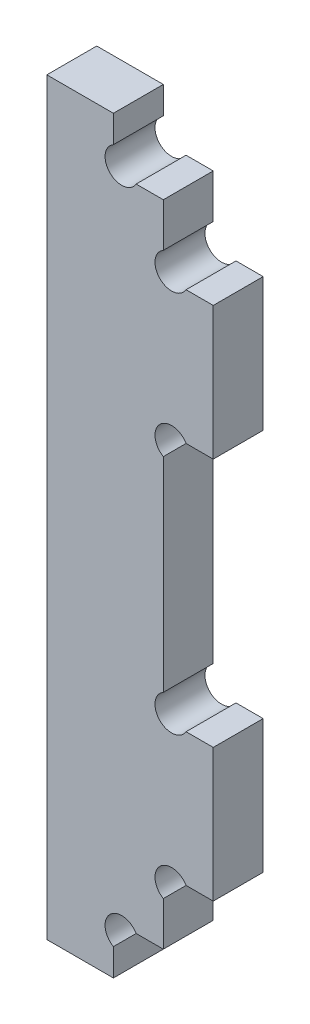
ISO-10303-21;
HEADER;
FILE_DESCRIPTION(('STEP AP214'),'2;1');
FILE_NAME('part.step','',(''),(''),'','','');
FILE_SCHEMA(('AUTOMOTIVE_DESIGN { 1 0 10303 214 1 1 1 1 }'));
ENDSEC;
DATA;
#1=APPLICATION_CONTEXT('core data for automotive mechanical design processes');
#2=APPLICATION_PROTOCOL_DEFINITION('international standard','automotive_design',2000,#1);
#3=PRODUCT_CONTEXT('',#1,'mechanical');
#4=PRODUCT('Part','Part','',(#3));
#5=PRODUCT_RELATED_PRODUCT_CATEGORY('part','',(#4));
#6=PRODUCT_DEFINITION_FORMATION('','',#4);
#7=PRODUCT_DEFINITION_CONTEXT('part definition',#1,'design');
#8=PRODUCT_DEFINITION('design','',#6,#7);
#9=PRODUCT_DEFINITION_SHAPE('','',#8);
#10=(LENGTH_UNIT() NAMED_UNIT(*) SI_UNIT(.MILLI.,.METRE.));
#11=(NAMED_UNIT(*) PLANE_ANGLE_UNIT() SI_UNIT($,.RADIAN.));
#12=(NAMED_UNIT(*) SI_UNIT($,.STERADIAN.) SOLID_ANGLE_UNIT());
#13=UNCERTAINTY_MEASURE_WITH_UNIT(LENGTH_MEASURE(1.E-05),#10,'distance_accuracy_value','');
#14=(GEOMETRIC_REPRESENTATION_CONTEXT(3) GLOBAL_UNCERTAINTY_ASSIGNED_CONTEXT((#13)) GLOBAL_UNIT_ASSIGNED_CONTEXT((#10,
#11,#12)) REPRESENTATION_CONTEXT('',''));
#15=CARTESIAN_POINT('',(0.,0.,0.));
#16=DIRECTION('',(0.,0.,1.));
#17=DIRECTION('',(1.,0.,0.));
#18=AXIS2_PLACEMENT_3D('',#15,#16,#17);
#19=CARTESIAN_POINT('',(0.,0.,3.));
#20=DIRECTION('',(0.,0.,-1.));
#21=DIRECTION('',(-1.,0.,0.));
#22=AXIS2_PLACEMENT_3D('',#19,#20,#21);
#23=PLANE('',#22);
#24=CARTESIAN_POINT('',(1.,20.,3.));
#25=DIRECTION('',(0.,0.,1.));
#26=DIRECTION('',(1.,0.,0.));
#27=AXIS2_PLACEMENT_3D('',#24,#25,#26);
#28=CIRCLE('',#27,0.999999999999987);
#29=CARTESIAN_POINT('',(0.500000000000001,20.8660254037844,3.));
#30=VERTEX_POINT('',#29);
#31=CARTESIAN_POINT('',(1.86602540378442,19.5,3.));
#32=VERTEX_POINT('',#31);
#33=EDGE_CURVE('E192',#30,#32,#28,.T.);
#34=ORIENTED_EDGE('',*,*,#33,.F.);
#35=DIRECTION('',(0.,1.,0.));
#36=VECTOR('',#35,1.);
#37=CARTESIAN_POINT('',(0.5,19.5,3.));
#38=LINE('',#37,#36);
#39=CARTESIAN_POINT('',(0.5,22.5,3.));
#40=VERTEX_POINT('',#39);
#41=EDGE_CURVE('E200',#30,#40,#38,.T.);
#42=ORIENTED_EDGE('',*,*,#41,.T.);
#43=DIRECTION('',(-1.,0.,0.));
#44=VECTOR('',#43,1.);
#45=CARTESIAN_POINT('',(-3.5,22.5,3.));
#46=LINE('',#45,#44);
#47=CARTESIAN_POINT('',(-3.5,22.5,3.));
#48=VERTEX_POINT('',#47);
#49=EDGE_CURVE('E213',#40,#48,#46,.T.);
#50=ORIENTED_EDGE('',*,*,#49,.T.);
#51=DIRECTION('',(0.,-1.,0.));
#52=VECTOR('',#51,1.);
#53=CARTESIAN_POINT('',(-3.5,-19.5,3.));
#54=LINE('',#53,#52);
#55=CARTESIAN_POINT('',(-3.5,-22.5,3.));
#56=VERTEX_POINT('',#55);
#57=EDGE_CURVE('E230',#48,#56,#54,.T.);
#58=ORIENTED_EDGE('',*,*,#57,.T.);
#59=DIRECTION('',(1.,0.,0.));
#60=VECTOR('',#59,1.);
#61=CARTESIAN_POINT('',(-3.5,-22.5,3.));
#62=LINE('',#61,#60);
#63=CARTESIAN_POINT('',(0.5,-22.5,3.));
#64=VERTEX_POINT('',#63);
#65=EDGE_CURVE('E269',#56,#64,#62,.T.);
#66=ORIENTED_EDGE('',*,*,#65,.T.);
#67=DIRECTION('',(0.,1.,0.));
#68=VECTOR('',#67,1.);
#69=CARTESIAN_POINT('',(0.5,-19.5,3.));
#70=LINE('',#69,#68);
#71=CARTESIAN_POINT('',(0.500000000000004,-20.8660254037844,3.));
#72=VERTEX_POINT('',#71);
#73=EDGE_CURVE('E259',#64,#72,#70,.T.);
#74=ORIENTED_EDGE('',*,*,#73,.T.);
#75=CARTESIAN_POINT('',(1.,-20.,3.));
#76=DIRECTION('',(0.,0.,1.));
#77=DIRECTION('',(1.,0.,0.));
#78=AXIS2_PLACEMENT_3D('',#75,#76,#77);
#79=CIRCLE('',#78,0.999999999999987);
#80=CARTESIAN_POINT('',(1.86602540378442,-19.5,3.));
#81=VERTEX_POINT('',#80);
#82=EDGE_CURVE('E266',#81,#72,#79,.T.);
#83=ORIENTED_EDGE('',*,*,#82,.F.);
#84=DIRECTION('',(1.,0.,0.));
#85=VECTOR('',#84,1.);
#86=CARTESIAN_POINT('',(-3.5,-19.5,3.));
#87=LINE('',#86,#85);
#88=CARTESIAN_POINT('',(3.5,-19.5,3.));
#89=VERTEX_POINT('',#88);
#90=EDGE_CURVE('E232',#81,#89,#87,.T.);
#91=ORIENTED_EDGE('',*,*,#90,.T.);
#92=DIRECTION('',(0.,1.,0.));
#93=VECTOR('',#92,1.);
#94=CARTESIAN_POINT('',(3.5,-19.5,3.));
#95=LINE('',#94,#93);
#96=CARTESIAN_POINT('',(3.5,-16.8660254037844,3.));
#97=VERTEX_POINT('',#96);
#98=EDGE_CURVE('E222',#89,#97,#95,.T.);
#99=ORIENTED_EDGE('',*,*,#98,.T.);
#100=CARTESIAN_POINT('',(4.,-16.,3.));
#101=DIRECTION('',(0.,0.,1.));
#102=DIRECTION('',(1.,0.,0.));
#103=AXIS2_PLACEMENT_3D('',#100,#101,#102);
#104=CIRCLE('',#103,0.999999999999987);
#105=CARTESIAN_POINT('',(4.86602540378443,-15.5,3.));
#106=VERTEX_POINT('',#105);
#107=EDGE_CURVE('E309',#106,#97,#104,.T.);
#108=ORIENTED_EDGE('',*,*,#107,.F.);
#109=DIRECTION('',(1.,0.,0.));
#110=VECTOR('',#109,1.);
#111=CARTESIAN_POINT('',(3.5,-15.5,3.));
#112=LINE('',#111,#110);
#113=CARTESIAN_POINT('',(6.5,-15.5,3.));
#114=VERTEX_POINT('',#113);
#115=EDGE_CURVE('E341',#106,#114,#112,.T.);
#116=ORIENTED_EDGE('',*,*,#115,.T.);
#117=DIRECTION('',(0.,1.,0.));
#118=VECTOR('',#117,1.);
#119=CARTESIAN_POINT('',(6.5,-15.5,3.));
#120=LINE('',#119,#118);
#121=CARTESIAN_POINT('',(6.5,-7.5,3.));
#122=VERTEX_POINT('',#121);
#123=EDGE_CURVE('E343',#114,#122,#120,.T.);
#124=ORIENTED_EDGE('',*,*,#123,.T.);
#125=DIRECTION('',(-1.,0.,0.));
#126=VECTOR('',#125,1.);
#127=CARTESIAN_POINT('',(3.5,-7.5,3.));
#128=LINE('',#127,#126);
#129=CARTESIAN_POINT('',(4.86602540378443,-7.5,3.));
#130=VERTEX_POINT('',#129);
#131=EDGE_CURVE('E346',#122,#130,#128,.T.);
#132=ORIENTED_EDGE('',*,*,#131,.T.);
#133=CARTESIAN_POINT('',(4.,-7.,3.));
#134=DIRECTION('',(0.,0.,1.));
#135=DIRECTION('',(1.,0.,0.));
#136=AXIS2_PLACEMENT_3D('',#133,#134,#135);
#137=CIRCLE('',#136,0.999999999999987);
#138=CARTESIAN_POINT('',(3.5,-6.13397459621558,3.));
#139=VERTEX_POINT('',#138);
#140=EDGE_CURVE('E296',#139,#130,#137,.T.);
#141=ORIENTED_EDGE('',*,*,#140,.F.);
#142=CARTESIAN_POINT('',(3.5,6.13397459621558,3.));
#143=VERTEX_POINT('',#142);
#144=EDGE_CURVE('E226',#139,#143,#95,.T.);
#145=ORIENTED_EDGE('',*,*,#144,.T.);
#146=CARTESIAN_POINT('',(4.,7.,3.));
#147=DIRECTION('',(0.,0.,1.));
#148=DIRECTION('',(1.,0.,0.));
#149=AXIS2_PLACEMENT_3D('',#146,#147,#148);
#150=CIRCLE('',#149,0.999999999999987);
#151=CARTESIAN_POINT('',(4.86602540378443,7.5,3.));
#152=VERTEX_POINT('',#151);
#153=EDGE_CURVE('E431',#152,#143,#150,.T.);
#154=ORIENTED_EDGE('',*,*,#153,.F.);
#155=DIRECTION('',(1.,0.,0.));
#156=VECTOR('',#155,1.);
#157=CARTESIAN_POINT('',(3.5,7.5,3.));
#158=LINE('',#157,#156);
#159=CARTESIAN_POINT('',(6.5,7.5,3.));
#160=VERTEX_POINT('',#159);
#161=EDGE_CURVE('E321',#152,#160,#158,.T.);
#162=ORIENTED_EDGE('',*,*,#161,.T.);
#163=DIRECTION('',(0.,1.,0.));
#164=VECTOR('',#163,1.);
#165=CARTESIAN_POINT('',(6.5,15.5,3.));
#166=LINE('',#165,#164);
#167=CARTESIAN_POINT('',(6.5,15.5,3.));
#168=VERTEX_POINT('',#167);
#169=EDGE_CURVE('E323',#160,#168,#166,.T.);
#170=ORIENTED_EDGE('',*,*,#169,.T.);
#171=DIRECTION('',(-1.,0.,0.));
#172=VECTOR('',#171,1.);
#173=CARTESIAN_POINT('',(3.5,15.5,3.));
#174=LINE('',#173,#172);
#175=CARTESIAN_POINT('',(4.86602540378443,15.5,3.));
#176=VERTEX_POINT('',#175);
#177=EDGE_CURVE('E326',#168,#176,#174,.T.);
#178=ORIENTED_EDGE('',*,*,#177,.T.);
#179=CARTESIAN_POINT('',(4.,16.,3.));
#180=DIRECTION('',(0.,0.,1.));
#181=DIRECTION('',(1.,0.,0.));
#182=AXIS2_PLACEMENT_3D('',#179,#180,#181);
#183=CIRCLE('',#182,0.999999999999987);
#184=CARTESIAN_POINT('',(3.5,16.8660254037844,3.));
#185=VERTEX_POINT('',#184);
#186=EDGE_CURVE('E439',#185,#176,#183,.T.);
#187=ORIENTED_EDGE('',*,*,#186,.F.);
#188=CARTESIAN_POINT('',(3.5,19.5,3.));
#189=VERTEX_POINT('',#188);
#190=EDGE_CURVE('E227',#185,#189,#95,.T.);
#191=ORIENTED_EDGE('',*,*,#190,.T.);
#192=DIRECTION('',(-1.,0.,0.));
#193=VECTOR('',#192,1.);
#194=CARTESIAN_POINT('',(-3.5,19.5,3.));
#195=LINE('',#194,#193);
#196=EDGE_CURVE('E225',#189,#32,#195,.T.);
#197=ORIENTED_EDGE('',*,*,#196,.T.);
#198=EDGE_LOOP('',(#34,#42,#50,#58,#66,#74,#83,#91,#99,#108,#116,#124,#132,#141,#145,#154,#162,
#170,#178,#187,#191,#197));
#199=FACE_BOUND('',#198,.T.);
#200=ADVANCED_FACE('F37',(#199),#23,.F.);
#201=CARTESIAN_POINT('',(0.,0.,0.));
#202=DIRECTION('',(0.,0.,-1.));
#203=DIRECTION('',(-1.,0.,0.));
#204=AXIS2_PLACEMENT_3D('',#201,#202,#203);
#205=PLANE('',#204);
#206=DIRECTION('',(0.,1.,0.));
#207=VECTOR('',#206,1.);
#208=CARTESIAN_POINT('',(0.5,19.5,0.));
#209=LINE('',#208,#207);
#210=CARTESIAN_POINT('',(0.500000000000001,20.8660254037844,0.));
#211=VERTEX_POINT('',#210);
#212=CARTESIAN_POINT('',(0.5,22.5,0.));
#213=VERTEX_POINT('',#212);
#214=EDGE_CURVE('E198',#211,#213,#209,.T.);
#215=ORIENTED_EDGE('',*,*,#214,.F.);
#216=CARTESIAN_POINT('',(1.,20.,0.));
#217=DIRECTION('',(0.,0.,1.));
#218=DIRECTION('',(1.,0.,0.));
#219=AXIS2_PLACEMENT_3D('',#216,#217,#218);
#220=CIRCLE('',#219,0.999999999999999);
#221=CARTESIAN_POINT('',(1.86602540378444,19.5,0.));
#222=VERTEX_POINT('',#221);
#223=EDGE_CURVE('E183',#211,#222,#220,.T.);
#224=ORIENTED_EDGE('',*,*,#223,.T.);
#225=DIRECTION('',(-1.,0.,0.));
#226=VECTOR('',#225,1.);
#227=CARTESIAN_POINT('',(-3.5,19.5,0.));
#228=LINE('',#227,#226);
#229=CARTESIAN_POINT('',(3.5,19.5,0.));
#230=VERTEX_POINT('',#229);
#231=EDGE_CURVE('E238',#230,#222,#228,.T.);
#232=ORIENTED_EDGE('',*,*,#231,.F.);
#233=DIRECTION('',(0.,1.,0.));
#234=VECTOR('',#233,1.);
#235=CARTESIAN_POINT('',(3.5,-19.5,0.));
#236=LINE('',#235,#234);
#237=CARTESIAN_POINT('',(3.5,16.8660254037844,0.));
#238=VERTEX_POINT('',#237);
#239=EDGE_CURVE('E221',#238,#230,#236,.T.);
#240=ORIENTED_EDGE('',*,*,#239,.F.);
#241=CARTESIAN_POINT('',(4.,16.,0.));
#242=DIRECTION('',(0.,0.,1.));
#243=DIRECTION('',(1.,0.,0.));
#244=AXIS2_PLACEMENT_3D('',#241,#242,#243);
#245=CIRCLE('',#244,0.999999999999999);
#246=CARTESIAN_POINT('',(4.86602540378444,15.5,0.));
#247=VERTEX_POINT('',#246);
#248=EDGE_CURVE('E421',#238,#247,#245,.T.);
#249=ORIENTED_EDGE('',*,*,#248,.T.);
#250=DIRECTION('',(-1.,0.,0.));
#251=VECTOR('',#250,1.);
#252=CARTESIAN_POINT('',(3.5,15.5,0.));
#253=LINE('',#252,#251);
#254=CARTESIAN_POINT('',(6.5,15.5,0.));
#255=VERTEX_POINT('',#254);
#256=EDGE_CURVE('E324',#255,#247,#253,.T.);
#257=ORIENTED_EDGE('',*,*,#256,.F.);
#258=DIRECTION('',(0.,1.,0.));
#259=VECTOR('',#258,1.);
#260=CARTESIAN_POINT('',(6.5,15.5,0.));
#261=LINE('',#260,#259);
#262=CARTESIAN_POINT('',(6.5,7.5,0.));
#263=VERTEX_POINT('',#262);
#264=EDGE_CURVE('E331',#263,#255,#261,.T.);
#265=ORIENTED_EDGE('',*,*,#264,.F.);
#266=DIRECTION('',(1.,0.,0.));
#267=VECTOR('',#266,1.);
#268=CARTESIAN_POINT('',(3.5,7.5,0.));
#269=LINE('',#268,#267);
#270=CARTESIAN_POINT('',(4.86602540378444,7.5,0.));
#271=VERTEX_POINT('',#270);
#272=EDGE_CURVE('E320',#271,#263,#269,.T.);
#273=ORIENTED_EDGE('',*,*,#272,.F.);
#274=CARTESIAN_POINT('',(4.,7.,0.));
#275=DIRECTION('',(0.,0.,1.));
#276=DIRECTION('',(1.,0.,0.));
#277=AXIS2_PLACEMENT_3D('',#274,#275,#276);
#278=CIRCLE('',#277,0.999999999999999);
#279=CARTESIAN_POINT('',(3.5,6.13397459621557,0.));
#280=VERTEX_POINT('',#279);
#281=EDGE_CURVE('E429',#271,#280,#278,.T.);
#282=ORIENTED_EDGE('',*,*,#281,.T.);
#283=CARTESIAN_POINT('',(3.5,-6.13397459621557,0.));
#284=VERTEX_POINT('',#283);
#285=EDGE_CURVE('E239',#284,#280,#236,.T.);
#286=ORIENTED_EDGE('',*,*,#285,.F.);
#287=CARTESIAN_POINT('',(4.,-7.,0.));
#288=DIRECTION('',(0.,0.,1.));
#289=DIRECTION('',(1.,0.,0.));
#290=AXIS2_PLACEMENT_3D('',#287,#288,#289);
#291=CIRCLE('',#290,0.999999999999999);
#292=CARTESIAN_POINT('',(4.86602540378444,-7.5,0.));
#293=VERTEX_POINT('',#292);
#294=EDGE_CURVE('E303',#284,#293,#291,.T.);
#295=ORIENTED_EDGE('',*,*,#294,.T.);
#296=DIRECTION('',(-1.,0.,0.));
#297=VECTOR('',#296,1.);
#298=CARTESIAN_POINT('',(3.5,-7.5,0.));
#299=LINE('',#298,#297);
#300=CARTESIAN_POINT('',(6.5,-7.5,0.));
#301=VERTEX_POINT('',#300);
#302=EDGE_CURVE('E344',#301,#293,#299,.T.);
#303=ORIENTED_EDGE('',*,*,#302,.F.);
#304=DIRECTION('',(0.,1.,0.));
#305=VECTOR('',#304,1.);
#306=CARTESIAN_POINT('',(6.5,-15.5,0.));
#307=LINE('',#306,#305);
#308=CARTESIAN_POINT('',(6.5,-15.5,0.));
#309=VERTEX_POINT('',#308);
#310=EDGE_CURVE('E351',#309,#301,#307,.T.);
#311=ORIENTED_EDGE('',*,*,#310,.F.);
#312=DIRECTION('',(1.,0.,0.));
#313=VECTOR('',#312,1.);
#314=CARTESIAN_POINT('',(3.5,-15.5,0.));
#315=LINE('',#314,#313);
#316=CARTESIAN_POINT('',(4.86602540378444,-15.5,0.));
#317=VERTEX_POINT('',#316);
#318=EDGE_CURVE('E340',#317,#309,#315,.T.);
#319=ORIENTED_EDGE('',*,*,#318,.F.);
#320=CARTESIAN_POINT('',(4.,-16.,0.));
#321=DIRECTION('',(0.,0.,1.));
#322=DIRECTION('',(1.,0.,0.));
#323=AXIS2_PLACEMENT_3D('',#320,#321,#322);
#324=CIRCLE('',#323,0.999999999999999);
#325=CARTESIAN_POINT('',(3.5,-16.8660254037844,0.));
#326=VERTEX_POINT('',#325);
#327=EDGE_CURVE('E311',#317,#326,#324,.T.);
#328=ORIENTED_EDGE('',*,*,#327,.T.);
#329=CARTESIAN_POINT('',(3.5,-19.5,0.));
#330=VERTEX_POINT('',#329);
#331=EDGE_CURVE('E235',#330,#326,#236,.T.);
#332=ORIENTED_EDGE('',*,*,#331,.F.);
#333=DIRECTION('',(1.,0.,0.));
#334=VECTOR('',#333,1.);
#335=CARTESIAN_POINT('',(-3.5,-19.5,0.));
#336=LINE('',#335,#334);
#337=CARTESIAN_POINT('',(1.86602540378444,-19.5,0.));
#338=VERTEX_POINT('',#337);
#339=EDGE_CURVE('E243',#338,#330,#336,.T.);
#340=ORIENTED_EDGE('',*,*,#339,.F.);
#341=CARTESIAN_POINT('',(1.,-20.,0.));
#342=DIRECTION('',(0.,0.,1.));
#343=DIRECTION('',(1.,0.,0.));
#344=AXIS2_PLACEMENT_3D('',#341,#342,#343);
#345=CIRCLE('',#344,0.999999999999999);
#346=CARTESIAN_POINT('',(0.5,-20.8660254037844,0.));
#347=VERTEX_POINT('',#346);
#348=EDGE_CURVE('E291',#338,#347,#345,.T.);
#349=ORIENTED_EDGE('',*,*,#348,.T.);
#350=DIRECTION('',(0.,1.,0.));
#351=VECTOR('',#350,1.);
#352=CARTESIAN_POINT('',(0.5,-19.5,0.));
#353=LINE('',#352,#351);
#354=CARTESIAN_POINT('',(0.5,-22.5,0.));
#355=VERTEX_POINT('',#354);
#356=EDGE_CURVE('E261',#355,#347,#353,.T.);
#357=ORIENTED_EDGE('',*,*,#356,.F.);
#358=DIRECTION('',(1.,0.,0.));
#359=VECTOR('',#358,1.);
#360=CARTESIAN_POINT('',(-3.5,-22.5,0.));
#361=LINE('',#360,#359);
#362=CARTESIAN_POINT('',(-3.5,-22.5,0.));
#363=VERTEX_POINT('',#362);
#364=EDGE_CURVE('E276',#363,#355,#361,.T.);
#365=ORIENTED_EDGE('',*,*,#364,.F.);
#366=DIRECTION('',(0.,-1.,0.));
#367=VECTOR('',#366,1.);
#368=CARTESIAN_POINT('',(-3.5,-19.5,0.));
#369=LINE('',#368,#367);
#370=CARTESIAN_POINT('',(-3.5,22.5,0.));
#371=VERTEX_POINT('',#370);
#372=EDGE_CURVE('E241',#371,#363,#369,.T.);
#373=ORIENTED_EDGE('',*,*,#372,.F.);
#374=DIRECTION('',(-1.,0.,0.));
#375=VECTOR('',#374,1.);
#376=CARTESIAN_POINT('',(-3.5,22.5,0.));
#377=LINE('',#376,#375);
#378=EDGE_CURVE('E205',#213,#371,#377,.T.);
#379=ORIENTED_EDGE('',*,*,#378,.F.);
#380=EDGE_LOOP('',(#215,#224,#232,#240,#249,#257,#265,#273,#282,#286,#295,#303,#311,#319,#328,
#332,#340,#349,#357,#365,#373,#379));
#381=FACE_BOUND('',#380,.T.);
#382=ADVANCED_FACE('F203',(#381),#205,.T.);
#383=CARTESIAN_POINT('',(3.5,-19.5,3.));
#384=DIRECTION('',(-1.,0.,0.));
#385=DIRECTION('',(0.,0.,1.));
#386=AXIS2_PLACEMENT_3D('',#383,#384,#385);
#387=PLANE('',#386);
#388=ORIENTED_EDGE('',*,*,#285,.T.);
#389=DIRECTION('',(0.,0.,1.));
#390=VECTOR('',#389,1.);
#391=CARTESIAN_POINT('',(3.5,6.13397459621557,3.));
#392=LINE('',#391,#390);
#393=EDGE_CURVE('E298',#280,#143,#392,.T.);
#394=ORIENTED_EDGE('',*,*,#393,.T.);
#395=ORIENTED_EDGE('',*,*,#144,.F.);
#396=DIRECTION('',(0.,0.,1.));
#397=VECTOR('',#396,1.);
#398=CARTESIAN_POINT('',(3.5,-6.13397459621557,3.));
#399=LINE('',#398,#397);
#400=EDGE_CURVE('E306',#139,#284,#399,.F.);
#401=ORIENTED_EDGE('',*,*,#400,.T.);
#402=EDGE_LOOP('',(#388,#394,#395,#401));
#403=FACE_BOUND('',#402,.T.);
#404=ADVANCED_FACE('F39',(#403),#387,.F.);
#405=ORIENTED_EDGE('',*,*,#190,.F.);
#406=DIRECTION('',(0.,0.,1.));
#407=VECTOR('',#406,1.);
#408=CARTESIAN_POINT('',(3.5,16.8660254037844,3.));
#409=LINE('',#408,#407);
#410=EDGE_CURVE('E433',#185,#238,#409,.F.);
#411=ORIENTED_EDGE('',*,*,#410,.T.);
#412=ORIENTED_EDGE('',*,*,#239,.T.);
#413=DIRECTION('',(0.,0.,-1.));
#414=VECTOR('',#413,1.);
#415=CARTESIAN_POINT('',(3.5,19.5,3.));
#416=LINE('',#415,#414);
#417=EDGE_CURVE('E247',#189,#230,#416,.T.);
#418=ORIENTED_EDGE('',*,*,#417,.F.);
#419=EDGE_LOOP('',(#405,#411,#412,#418));
#420=FACE_BOUND('',#419,.T.);
#421=ADVANCED_FACE('F416',(#420),#387,.F.);
#422=ORIENTED_EDGE('',*,*,#331,.T.);
#423=DIRECTION('',(0.,0.,1.));
#424=VECTOR('',#423,1.);
#425=CARTESIAN_POINT('',(3.5,-16.8660254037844,3.));
#426=LINE('',#425,#424);
#427=EDGE_CURVE('E317',#326,#97,#426,.T.);
#428=ORIENTED_EDGE('',*,*,#427,.T.);
#429=ORIENTED_EDGE('',*,*,#98,.F.);
#430=DIRECTION('',(0.,0.,-1.));
#431=VECTOR('',#430,1.);
#432=CARTESIAN_POINT('',(3.5,-19.5,3.));
#433=LINE('',#432,#431);
#434=EDGE_CURVE('E234',#89,#330,#433,.T.);
#435=ORIENTED_EDGE('',*,*,#434,.T.);
#436=EDGE_LOOP('',(#422,#428,#429,#435));
#437=FACE_BOUND('',#436,.T.);
#438=ADVANCED_FACE('F380',(#437),#387,.F.);
#439=CARTESIAN_POINT('',(-3.5,19.5,3.));
#440=DIRECTION('',(0.,-1.,0.));
#441=DIRECTION('',(0.,0.,-1.));
#442=AXIS2_PLACEMENT_3D('',#439,#440,#441);
#443=PLANE('',#442);
#444=ORIENTED_EDGE('',*,*,#231,.T.);
#445=DIRECTION('',(0.,0.,1.));
#446=VECTOR('',#445,1.);
#447=CARTESIAN_POINT('',(1.86602540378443,19.5,3.));
#448=LINE('',#447,#446);
#449=EDGE_CURVE('E52',#222,#32,#448,.T.);
#450=ORIENTED_EDGE('',*,*,#449,.T.);
#451=ORIENTED_EDGE('',*,*,#196,.F.);
#452=ORIENTED_EDGE('',*,*,#417,.T.);
#453=EDGE_LOOP('',(#444,#450,#451,#452));
#454=FACE_BOUND('',#453,.T.);
#455=ADVANCED_FACE('F410',(#454),#443,.F.);
#456=CARTESIAN_POINT('',(-3.5,-19.5,3.));
#457=DIRECTION('',(1.,0.,0.));
#458=DIRECTION('',(0.,0.,-1.));
#459=AXIS2_PLACEMENT_3D('',#456,#457,#458);
#460=PLANE('',#459);
#461=ORIENTED_EDGE('',*,*,#372,.T.);
#462=DIRECTION('',(0.,0.,-1.));
#463=VECTOR('',#462,1.);
#464=CARTESIAN_POINT('',(-3.5,-22.5,3.));
#465=LINE('',#464,#463);
#466=EDGE_CURVE('E206',#56,#363,#465,.T.);
#467=ORIENTED_EDGE('',*,*,#466,.F.);
#468=ORIENTED_EDGE('',*,*,#57,.F.);
#469=DIRECTION('',(0.,0.,-1.));
#470=VECTOR('',#469,1.);
#471=CARTESIAN_POINT('',(-3.5,22.5,3.));
#472=LINE('',#471,#470);
#473=EDGE_CURVE('E216',#48,#371,#472,.T.);
#474=ORIENTED_EDGE('',*,*,#473,.T.);
#475=EDGE_LOOP('',(#461,#467,#468,#474));
#476=FACE_BOUND('',#475,.T.);
#477=ADVANCED_FACE('F285',(#476),#460,.F.);
#478=CARTESIAN_POINT('',(-3.5,-19.5,3.));
#479=DIRECTION('',(0.,1.,0.));
#480=DIRECTION('',(0.,0.,1.));
#481=AXIS2_PLACEMENT_3D('',#478,#479,#480);
#482=PLANE('',#481);
#483=ORIENTED_EDGE('',*,*,#90,.F.);
#484=DIRECTION('',(0.,0.,1.));
#485=VECTOR('',#484,1.);
#486=CARTESIAN_POINT('',(1.86602540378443,-19.5,3.));
#487=LINE('',#486,#485);
#488=EDGE_CURVE('E294',#81,#338,#487,.F.);
#489=ORIENTED_EDGE('',*,*,#488,.T.);
#490=ORIENTED_EDGE('',*,*,#339,.T.);
#491=ORIENTED_EDGE('',*,*,#434,.F.);
#492=EDGE_LOOP('',(#483,#489,#490,#491));
#493=FACE_BOUND('',#492,.T.);
#494=ADVANCED_FACE('F383',(#493),#482,.F.);
#495=CARTESIAN_POINT('',(0.5,19.5,3.));
#496=DIRECTION('',(-1.,0.,0.));
#497=DIRECTION('',(0.,0.,1.));
#498=AXIS2_PLACEMENT_3D('',#495,#496,#497);
#499=PLANE('',#498);
#500=ORIENTED_EDGE('',*,*,#41,.F.);
#501=DIRECTION('',(0.,0.,1.));
#502=VECTOR('',#501,1.);
#503=CARTESIAN_POINT('',(0.5,20.8660254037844,3.));
#504=LINE('',#503,#502);
#505=EDGE_CURVE('E186',#30,#211,#504,.F.);
#506=ORIENTED_EDGE('',*,*,#505,.T.);
#507=ORIENTED_EDGE('',*,*,#214,.T.);
#508=DIRECTION('',(0.,0.,-1.));
#509=VECTOR('',#508,1.);
#510=CARTESIAN_POINT('',(0.5,22.5,3.));
#511=LINE('',#510,#509);
#512=EDGE_CURVE('E219',#40,#213,#511,.T.);
#513=ORIENTED_EDGE('',*,*,#512,.F.);
#514=EDGE_LOOP('',(#500,#506,#507,#513));
#515=FACE_BOUND('',#514,.T.);
#516=ADVANCED_FACE('F196',(#515),#499,.F.);
#517=CARTESIAN_POINT('',(-3.5,22.5,3.));
#518=DIRECTION('',(0.,-1.,0.));
#519=DIRECTION('',(0.,0.,-1.));
#520=AXIS2_PLACEMENT_3D('',#517,#518,#519);
#521=PLANE('',#520);
#522=ORIENTED_EDGE('',*,*,#378,.T.);
#523=ORIENTED_EDGE('',*,*,#473,.F.);
#524=ORIENTED_EDGE('',*,*,#49,.F.);
#525=ORIENTED_EDGE('',*,*,#512,.T.);
#526=EDGE_LOOP('',(#522,#523,#524,#525));
#527=FACE_BOUND('',#526,.T.);
#528=ADVANCED_FACE('F283',(#527),#521,.F.);
#529=CARTESIAN_POINT('',(-3.5,-22.5,3.));
#530=DIRECTION('',(0.,1.,0.));
#531=DIRECTION('',(0.,0.,1.));
#532=AXIS2_PLACEMENT_3D('',#529,#530,#531);
#533=PLANE('',#532);
#534=ORIENTED_EDGE('',*,*,#364,.T.);
#535=DIRECTION('',(0.,0.,-1.));
#536=VECTOR('',#535,1.);
#537=CARTESIAN_POINT('',(0.5,-22.5,3.));
#538=LINE('',#537,#536);
#539=EDGE_CURVE('E210',#64,#355,#538,.T.);
#540=ORIENTED_EDGE('',*,*,#539,.F.);
#541=ORIENTED_EDGE('',*,*,#65,.F.);
#542=ORIENTED_EDGE('',*,*,#466,.T.);
#543=EDGE_LOOP('',(#534,#540,#541,#542));
#544=FACE_BOUND('',#543,.T.);
#545=ADVANCED_FACE('F289',(#544),#533,.F.);
#546=CARTESIAN_POINT('',(0.5,-19.5,3.));
#547=DIRECTION('',(-1.,0.,0.));
#548=DIRECTION('',(0.,0.,1.));
#549=AXIS2_PLACEMENT_3D('',#546,#547,#548);
#550=PLANE('',#549);
#551=ORIENTED_EDGE('',*,*,#356,.T.);
#552=DIRECTION('',(0.,0.,1.));
#553=VECTOR('',#552,1.);
#554=CARTESIAN_POINT('',(0.5,-20.8660254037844,3.));
#555=LINE('',#554,#553);
#556=EDGE_CURVE('E45',#347,#72,#555,.T.);
#557=ORIENTED_EDGE('',*,*,#556,.T.);
#558=ORIENTED_EDGE('',*,*,#73,.F.);
#559=ORIENTED_EDGE('',*,*,#539,.T.);
#560=EDGE_LOOP('',(#551,#557,#558,#559));
#561=FACE_BOUND('',#560,.T.);
#562=ADVANCED_FACE('F257',(#561),#550,.F.);
#563=CARTESIAN_POINT('',(3.5,-15.5,3.));
#564=DIRECTION('',(0.,1.,0.));
#565=DIRECTION('',(0.,0.,1.));
#566=AXIS2_PLACEMENT_3D('',#563,#564,#565);
#567=PLANE('',#566);
#568=ORIENTED_EDGE('',*,*,#115,.F.);
#569=DIRECTION('',(0.,0.,1.));
#570=VECTOR('',#569,1.);
#571=CARTESIAN_POINT('',(4.86602540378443,-15.5,3.));
#572=LINE('',#571,#570);
#573=EDGE_CURVE('E314',#106,#317,#572,.F.);
#574=ORIENTED_EDGE('',*,*,#573,.T.);
#575=ORIENTED_EDGE('',*,*,#318,.T.);
#576=DIRECTION('',(0.,0.,-1.));
#577=VECTOR('',#576,1.);
#578=CARTESIAN_POINT('',(6.5,-15.5,3.));
#579=LINE('',#578,#577);
#580=EDGE_CURVE('E278',#114,#309,#579,.T.);
#581=ORIENTED_EDGE('',*,*,#580,.F.);
#582=EDGE_LOOP('',(#568,#574,#575,#581));
#583=FACE_BOUND('',#582,.T.);
#584=ADVANCED_FACE('F365',(#583),#567,.F.);
#585=CARTESIAN_POINT('',(6.5,-15.5,3.));
#586=DIRECTION('',(-1.,0.,0.));
#587=DIRECTION('',(0.,-1.,0.));
#588=AXIS2_PLACEMENT_3D('',#585,#586,#587);
#589=PLANE('',#588);
#590=ORIENTED_EDGE('',*,*,#310,.T.);
#591=DIRECTION('',(0.,0.,-1.));
#592=VECTOR('',#591,1.);
#593=CARTESIAN_POINT('',(6.5,-7.5,3.));
#594=LINE('',#593,#592);
#595=EDGE_CURVE('E349',#122,#301,#594,.T.);
#596=ORIENTED_EDGE('',*,*,#595,.F.);
#597=ORIENTED_EDGE('',*,*,#123,.F.);
#598=ORIENTED_EDGE('',*,*,#580,.T.);
#599=EDGE_LOOP('',(#590,#596,#597,#598));
#600=FACE_BOUND('',#599,.T.);
#601=ADVANCED_FACE('F360',(#600),#589,.F.);
#602=CARTESIAN_POINT('',(3.5,-7.5,3.));
#603=DIRECTION('',(0.,-1.,0.));
#604=DIRECTION('',(1.,0.,0.));
#605=AXIS2_PLACEMENT_3D('',#602,#603,#604);
#606=PLANE('',#605);
#607=ORIENTED_EDGE('',*,*,#302,.T.);
#608=DIRECTION('',(0.,0.,1.));
#609=VECTOR('',#608,1.);
#610=CARTESIAN_POINT('',(4.86602540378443,-7.5,3.));
#611=LINE('',#610,#609);
#612=EDGE_CURVE('E250',#293,#130,#611,.T.);
#613=ORIENTED_EDGE('',*,*,#612,.T.);
#614=ORIENTED_EDGE('',*,*,#131,.F.);
#615=ORIENTED_EDGE('',*,*,#595,.T.);
#616=EDGE_LOOP('',(#607,#613,#614,#615));
#617=FACE_BOUND('',#616,.T.);
#618=ADVANCED_FACE('F370',(#617),#606,.F.);
#619=CARTESIAN_POINT('',(3.5,7.5,3.));
#620=DIRECTION('',(0.,1.,0.));
#621=DIRECTION('',(-1.,0.,0.));
#622=AXIS2_PLACEMENT_3D('',#619,#620,#621);
#623=PLANE('',#622);
#624=ORIENTED_EDGE('',*,*,#161,.F.);
#625=DIRECTION('',(0.,0.,1.));
#626=VECTOR('',#625,1.);
#627=CARTESIAN_POINT('',(4.86602540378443,7.5,3.));
#628=LINE('',#627,#626);
#629=EDGE_CURVE('E11',#152,#271,#628,.F.);
#630=ORIENTED_EDGE('',*,*,#629,.T.);
#631=ORIENTED_EDGE('',*,*,#272,.T.);
#632=DIRECTION('',(0.,0.,-1.));
#633=VECTOR('',#632,1.);
#634=CARTESIAN_POINT('',(6.5,7.5,3.));
#635=LINE('',#634,#633);
#636=EDGE_CURVE('E337',#160,#263,#635,.T.);
#637=ORIENTED_EDGE('',*,*,#636,.F.);
#638=EDGE_LOOP('',(#624,#630,#631,#637));
#639=FACE_BOUND('',#638,.T.);
#640=ADVANCED_FACE('F448',(#639),#623,.F.);
#641=CARTESIAN_POINT('',(6.5,15.5,3.));
#642=DIRECTION('',(-1.,0.,0.));
#643=DIRECTION('',(0.,-1.,0.));
#644=AXIS2_PLACEMENT_3D('',#641,#642,#643);
#645=PLANE('',#644);
#646=ORIENTED_EDGE('',*,*,#264,.T.);
#647=DIRECTION('',(0.,0.,-1.));
#648=VECTOR('',#647,1.);
#649=CARTESIAN_POINT('',(6.5,15.5,3.));
#650=LINE('',#649,#648);
#651=EDGE_CURVE('E329',#168,#255,#650,.T.);
#652=ORIENTED_EDGE('',*,*,#651,.F.);
#653=ORIENTED_EDGE('',*,*,#169,.F.);
#654=ORIENTED_EDGE('',*,*,#636,.T.);
#655=EDGE_LOOP('',(#646,#652,#653,#654));
#656=FACE_BOUND('',#655,.T.);
#657=ADVANCED_FACE('F452',(#656),#645,.F.);
#658=CARTESIAN_POINT('',(3.5,15.5,3.));
#659=DIRECTION('',(0.,-1.,0.));
#660=DIRECTION('',(0.,0.,-1.));
#661=AXIS2_PLACEMENT_3D('',#658,#659,#660);
#662=PLANE('',#661);
#663=ORIENTED_EDGE('',*,*,#256,.T.);
#664=DIRECTION('',(0.,0.,1.));
#665=VECTOR('',#664,1.);
#666=CARTESIAN_POINT('',(4.86602540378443,15.5,3.));
#667=LINE('',#666,#665);
#668=EDGE_CURVE('E60',#247,#176,#667,.T.);
#669=ORIENTED_EDGE('',*,*,#668,.T.);
#670=ORIENTED_EDGE('',*,*,#177,.F.);
#671=ORIENTED_EDGE('',*,*,#651,.T.);
#672=EDGE_LOOP('',(#663,#669,#670,#671));
#673=FACE_BOUND('',#672,.T.);
#674=ADVANCED_FACE('F455',(#673),#662,.F.);
#675=CARTESIAN_POINT('',(4.,-16.,3.));
#676=DIRECTION('',(0.,0.,1.));
#677=DIRECTION('',(1.,0.,0.));
#678=AXIS2_PLACEMENT_3D('',#675,#676,#677);
#679=CYLINDRICAL_SURFACE('',#678,0.999999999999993);
#680=ORIENTED_EDGE('',*,*,#327,.F.);
#681=ORIENTED_EDGE('',*,*,#573,.F.);
#682=ORIENTED_EDGE('',*,*,#107,.T.);
#683=ORIENTED_EDGE('',*,*,#427,.F.);
#684=EDGE_LOOP('',(#680,#681,#682,#683));
#685=FACE_BOUND('',#684,.T.);
#686=ADVANCED_FACE('F378',(#685),#679,.F.);
#687=CARTESIAN_POINT('',(4.,-7.,3.));
#688=DIRECTION('',(0.,0.,1.));
#689=DIRECTION('',(1.,0.,0.));
#690=AXIS2_PLACEMENT_3D('',#687,#688,#689);
#691=CYLINDRICAL_SURFACE('',#690,0.999999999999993);
#692=ORIENTED_EDGE('',*,*,#140,.T.);
#693=ORIENTED_EDGE('',*,*,#612,.F.);
#694=ORIENTED_EDGE('',*,*,#294,.F.);
#695=ORIENTED_EDGE('',*,*,#400,.F.);
#696=EDGE_LOOP('',(#692,#693,#694,#695));
#697=FACE_BOUND('',#696,.T.);
#698=ADVANCED_FACE('F387',(#697),#691,.F.);
#699=CARTESIAN_POINT('',(1.,-20.,3.));
#700=DIRECTION('',(0.,0.,1.));
#701=DIRECTION('',(1.,0.,0.));
#702=AXIS2_PLACEMENT_3D('',#699,#700,#701);
#703=CYLINDRICAL_SURFACE('',#702,0.999999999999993);
#704=ORIENTED_EDGE('',*,*,#82,.T.);
#705=ORIENTED_EDGE('',*,*,#556,.F.);
#706=ORIENTED_EDGE('',*,*,#348,.F.);
#707=ORIENTED_EDGE('',*,*,#488,.F.);
#708=EDGE_LOOP('',(#704,#705,#706,#707));
#709=FACE_BOUND('',#708,.T.);
#710=ADVANCED_FACE('F384',(#709),#703,.F.);
#711=CARTESIAN_POINT('',(4.,7.,3.));
#712=DIRECTION('',(0.,0.,1.));
#713=DIRECTION('',(1.,0.,0.));
#714=AXIS2_PLACEMENT_3D('',#711,#712,#713);
#715=CYLINDRICAL_SURFACE('',#714,0.999999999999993);
#716=ORIENTED_EDGE('',*,*,#281,.F.);
#717=ORIENTED_EDGE('',*,*,#629,.F.);
#718=ORIENTED_EDGE('',*,*,#153,.T.);
#719=ORIENTED_EDGE('',*,*,#393,.F.);
#720=EDGE_LOOP('',(#716,#717,#718,#719));
#721=FACE_BOUND('',#720,.T.);
#722=ADVANCED_FACE('F386',(#721),#715,.F.);
#723=CARTESIAN_POINT('',(4.,16.,3.));
#724=DIRECTION('',(0.,0.,1.));
#725=DIRECTION('',(1.,0.,0.));
#726=AXIS2_PLACEMENT_3D('',#723,#724,#725);
#727=CYLINDRICAL_SURFACE('',#726,0.999999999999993);
#728=ORIENTED_EDGE('',*,*,#186,.T.);
#729=ORIENTED_EDGE('',*,*,#668,.F.);
#730=ORIENTED_EDGE('',*,*,#248,.F.);
#731=ORIENTED_EDGE('',*,*,#410,.F.);
#732=EDGE_LOOP('',(#728,#729,#730,#731));
#733=FACE_BOUND('',#732,.T.);
#734=ADVANCED_FACE('F393',(#733),#727,.F.);
#735=CARTESIAN_POINT('',(1.,20.,3.));
#736=DIRECTION('',(0.,0.,1.));
#737=DIRECTION('',(1.,0.,0.));
#738=AXIS2_PLACEMENT_3D('',#735,#736,#737);
#739=CYLINDRICAL_SURFACE('',#738,0.999999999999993);
#740=ORIENTED_EDGE('',*,*,#223,.F.);
#741=ORIENTED_EDGE('',*,*,#505,.F.);
#742=ORIENTED_EDGE('',*,*,#33,.T.);
#743=ORIENTED_EDGE('',*,*,#449,.F.);
#744=EDGE_LOOP('',(#740,#741,#742,#743));
#745=FACE_BOUND('',#744,.T.);
#746=ADVANCED_FACE('F185',(#745),#739,.F.);
#747=CLOSED_SHELL('',(#200,#382,#404,#421,#438,#455,#477,#494,#516,#528,#545,#562,#584,#601,
#618,#640,#657,#674,#686,#698,#710,#722,#734,#746));
#748=MANIFOLD_SOLID_BREP('B2',#747);
#749=ADVANCED_BREP_SHAPE_REPRESENTATION('',(#18,#748),#14);
#750=SHAPE_DEFINITION_REPRESENTATION(#9,#749);
ENDSEC;
END-ISO-10303-21;
